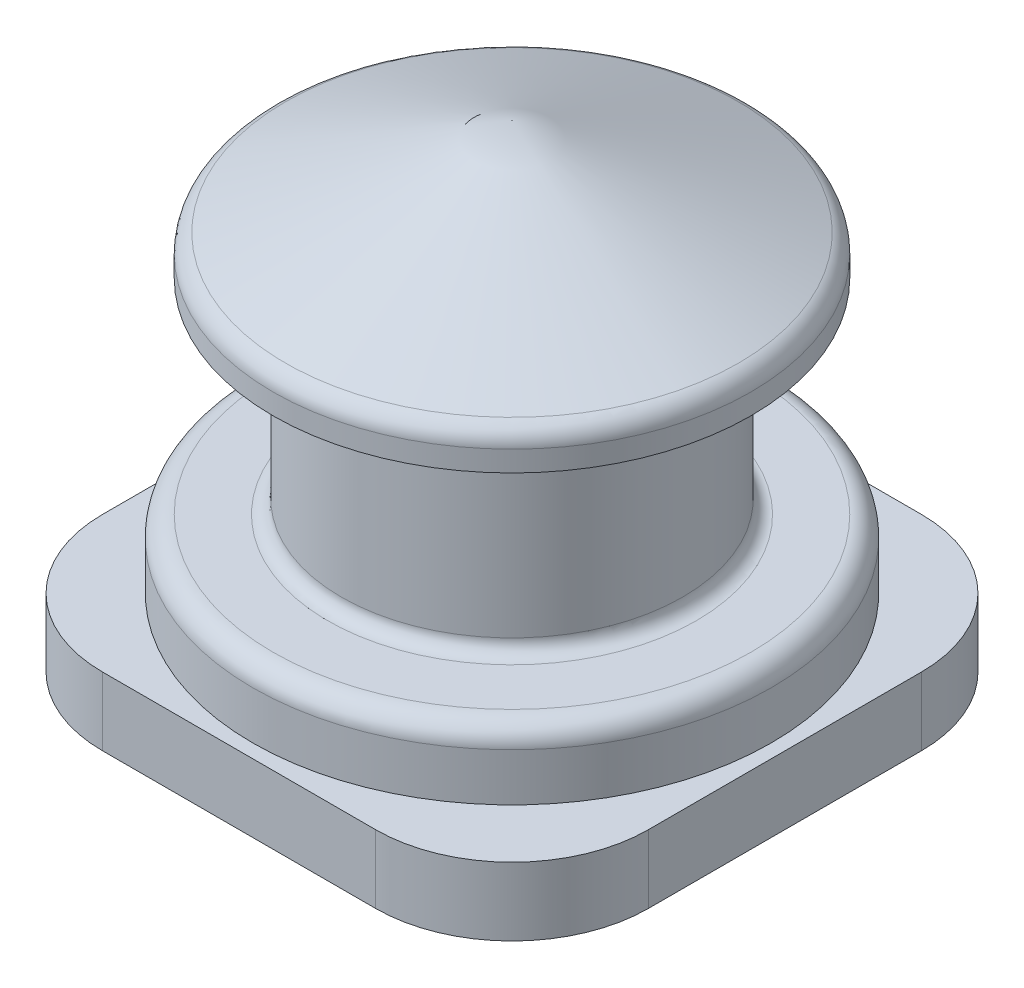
ISO-10303-21;
HEADER;
FILE_DESCRIPTION(('STEP AP214'),'2;1');
FILE_NAME('part.step','',(''),(''),'','','');
FILE_SCHEMA(('AUTOMOTIVE_DESIGN { 1 0 10303 214 1 1 1 1 }'));
ENDSEC;
DATA;
#1=APPLICATION_CONTEXT('core data for automotive mechanical design processes');
#2=APPLICATION_PROTOCOL_DEFINITION('international standard','automotive_design',2000,#1);
#3=PRODUCT_CONTEXT('',#1,'mechanical');
#4=PRODUCT('Part','Part','',(#3));
#5=PRODUCT_RELATED_PRODUCT_CATEGORY('part','',(#4));
#6=PRODUCT_DEFINITION_FORMATION('','',#4);
#7=PRODUCT_DEFINITION_CONTEXT('part definition',#1,'design');
#8=PRODUCT_DEFINITION('design','',#6,#7);
#9=PRODUCT_DEFINITION_SHAPE('','',#8);
#10=(LENGTH_UNIT() NAMED_UNIT(*) SI_UNIT(.MILLI.,.METRE.));
#11=(NAMED_UNIT(*) PLANE_ANGLE_UNIT() SI_UNIT($,.RADIAN.));
#12=(NAMED_UNIT(*) SI_UNIT($,.STERADIAN.) SOLID_ANGLE_UNIT());
#13=UNCERTAINTY_MEASURE_WITH_UNIT(LENGTH_MEASURE(1.E-05),#10,'distance_accuracy_value','');
#14=(GEOMETRIC_REPRESENTATION_CONTEXT(3) GLOBAL_UNCERTAINTY_ASSIGNED_CONTEXT((#13)) GLOBAL_UNIT_ASSIGNED_CONTEXT((#10,
#11,#12)) REPRESENTATION_CONTEXT('',''));
#15=CARTESIAN_POINT('',(0.,0.,0.));
#16=DIRECTION('',(0.,0.,1.));
#17=DIRECTION('',(1.,0.,0.));
#18=AXIS2_PLACEMENT_3D('',#15,#16,#17);
#19=CARTESIAN_POINT('',(0.,-10.,0.));
#20=DIRECTION('',(0.,1.,0.));
#21=DIRECTION('',(-1.,0.,0.));
#22=AXIS2_PLACEMENT_3D('',#19,#20,#21);
#23=PLANE('',#22);
#24=CARTESIAN_POINT('',(24.7487373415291,-10.,24.7487373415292));
#25=DIRECTION('',(0.,-1.,0.));
#26=DIRECTION('',(0.,0.,-1.));
#27=AXIS2_PLACEMENT_3D('',#24,#25,#26);
#28=CIRCLE('',#27,2.5);
#29=CARTESIAN_POINT('',(24.7487373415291,-10.,22.2487373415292));
#30=VERTEX_POINT('',#29);
#31=EDGE_CURVE('E127',#30,#30,#28,.T.);
#32=ORIENTED_EDGE('',*,*,#31,.F.);
#33=EDGE_LOOP('',(#32));
#34=FACE_BOUND('',#33,.T.);
#35=CARTESIAN_POINT('',(-24.7487373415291,-10.,-24.7487373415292));
#36=DIRECTION('',(0.,-1.,0.));
#37=DIRECTION('',(0.,0.,-1.));
#38=AXIS2_PLACEMENT_3D('',#35,#36,#37);
#39=CIRCLE('',#38,2.5);
#40=CARTESIAN_POINT('',(-24.7487373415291,-10.,-27.2487373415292));
#41=VERTEX_POINT('',#40);
#42=EDGE_CURVE('E144',#41,#41,#39,.T.);
#43=ORIENTED_EDGE('',*,*,#42,.F.);
#44=EDGE_LOOP('',(#43));
#45=FACE_BOUND('',#44,.T.);
#46=DIRECTION('',(1.,0.,0.));
#47=VECTOR('',#46,1.);
#48=CARTESIAN_POINT('',(-40.,-10.,-40.));
#49=LINE('',#48,#47);
#50=CARTESIAN_POINT('',(-20.,-10.,-40.));
#51=VERTEX_POINT('',#50);
#52=CARTESIAN_POINT('',(20.,-10.,-40.));
#53=VERTEX_POINT('',#52);
#54=EDGE_CURVE('E159',#51,#53,#49,.T.);
#55=ORIENTED_EDGE('',*,*,#54,.T.);
#56=CARTESIAN_POINT('',(20.,-10.,-20.));
#57=DIRECTION('',(0.,1.,0.));
#58=DIRECTION('',(-1.,0.,0.));
#59=AXIS2_PLACEMENT_3D('',#56,#57,#58);
#60=CIRCLE('',#59,20.);
#61=CARTESIAN_POINT('',(40.,-10.,-20.));
#62=VERTEX_POINT('',#61);
#63=EDGE_CURVE('E200',#53,#62,#60,.F.);
#64=ORIENTED_EDGE('',*,*,#63,.T.);
#65=DIRECTION('',(0.,0.,1.));
#66=VECTOR('',#65,1.);
#67=CARTESIAN_POINT('',(40.,-10.,-40.));
#68=LINE('',#67,#66);
#69=CARTESIAN_POINT('',(40.,-10.,20.));
#70=VERTEX_POINT('',#69);
#71=EDGE_CURVE('E151',#62,#70,#68,.T.);
#72=ORIENTED_EDGE('',*,*,#71,.T.);
#73=CARTESIAN_POINT('',(20.,-10.,20.));
#74=DIRECTION('',(0.,1.,0.));
#75=DIRECTION('',(-1.,0.,0.));
#76=AXIS2_PLACEMENT_3D('',#73,#74,#75);
#77=CIRCLE('',#76,20.);
#78=CARTESIAN_POINT('',(20.,-10.,40.));
#79=VERTEX_POINT('',#78);
#80=EDGE_CURVE('E195',#70,#79,#77,.F.);
#81=ORIENTED_EDGE('',*,*,#80,.T.);
#82=DIRECTION('',(-1.,0.,0.));
#83=VECTOR('',#82,1.);
#84=CARTESIAN_POINT('',(-40.,-10.,40.));
#85=LINE('',#84,#83);
#86=CARTESIAN_POINT('',(-20.,-10.,40.));
#87=VERTEX_POINT('',#86);
#88=EDGE_CURVE('E154',#79,#87,#85,.T.);
#89=ORIENTED_EDGE('',*,*,#88,.T.);
#90=CARTESIAN_POINT('',(-20.,-10.,20.));
#91=DIRECTION('',(0.,1.,0.));
#92=DIRECTION('',(-1.,0.,0.));
#93=AXIS2_PLACEMENT_3D('',#90,#91,#92);
#94=CIRCLE('',#93,20.);
#95=CARTESIAN_POINT('',(-40.,-10.,20.));
#96=VERTEX_POINT('',#95);
#97=EDGE_CURVE('E59',#87,#96,#94,.F.);
#98=ORIENTED_EDGE('',*,*,#97,.T.);
#99=DIRECTION('',(0.,0.,-1.));
#100=VECTOR('',#99,1.);
#101=CARTESIAN_POINT('',(-40.,-10.,-40.));
#102=LINE('',#101,#100);
#103=CARTESIAN_POINT('',(-40.,-10.,-20.));
#104=VERTEX_POINT('',#103);
#105=EDGE_CURVE('E157',#96,#104,#102,.T.);
#106=ORIENTED_EDGE('',*,*,#105,.T.);
#107=CARTESIAN_POINT('',(-20.,-10.,-20.));
#108=DIRECTION('',(0.,1.,0.));
#109=DIRECTION('',(-1.,0.,0.));
#110=AXIS2_PLACEMENT_3D('',#107,#108,#109);
#111=CIRCLE('',#110,20.);
#112=EDGE_CURVE('E198',#104,#51,#111,.F.);
#113=ORIENTED_EDGE('',*,*,#112,.T.);
#114=EDGE_LOOP('',(#55,#64,#72,#81,#89,#98,#106,#113));
#115=FACE_BOUND('',#114,.T.);
#116=CARTESIAN_POINT('',(-24.7487373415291,-10.,24.7487373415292));
#117=DIRECTION('',(0.,-1.,0.));
#118=DIRECTION('',(0.,0.,-1.));
#119=AXIS2_PLACEMENT_3D('',#116,#117,#118);
#120=CIRCLE('',#119,2.5);
#121=CARTESIAN_POINT('',(-24.7487373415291,-10.,22.2487373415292));
#122=VERTEX_POINT('',#121);
#123=EDGE_CURVE('E138',#122,#122,#120,.T.);
#124=ORIENTED_EDGE('',*,*,#123,.F.);
#125=EDGE_LOOP('',(#124));
#126=FACE_BOUND('',#125,.T.);
#127=CARTESIAN_POINT('',(24.748737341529,-10.,-24.7487373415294));
#128=DIRECTION('',(0.,-1.,0.));
#129=DIRECTION('',(0.,0.,-1.));
#130=AXIS2_PLACEMENT_3D('',#127,#128,#129);
#131=CIRCLE('',#130,2.5);
#132=CARTESIAN_POINT('',(24.748737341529,-10.,-27.2487373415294));
#133=VERTEX_POINT('',#132);
#134=EDGE_CURVE('E128',#133,#133,#131,.T.);
#135=ORIENTED_EDGE('',*,*,#134,.F.);
#136=EDGE_LOOP('',(#135));
#137=FACE_BOUND('',#136,.T.);
#138=ADVANCED_FACE('F37',(#34,#45,#115,#126,#137),#23,.F.);
#139=CARTESIAN_POINT('',(0.,60.,0.));
#140=DIRECTION('',(0.,1.,0.));
#141=DIRECTION('',(-1.,0.,0.));
#142=AXIS2_PLACEMENT_3D('',#139,#140,#141);
#143=CYLINDRICAL_SURFACE('',#142,38.);
#144=CARTESIAN_POINT('',(0.,7.,0.));
#145=DIRECTION('',(0.,-1.,0.));
#146=DIRECTION('',(1.,0.,0.));
#147=AXIS2_PLACEMENT_3D('',#144,#145,#146);
#148=CIRCLE('',#147,38.);
#149=CARTESIAN_POINT('',(38.,7.,0.));
#150=VERTEX_POINT('',#149);
#151=EDGE_CURVE('E11',#150,#150,#148,.T.);
#152=ORIENTED_EDGE('',*,*,#151,.T.);
#153=EDGE_LOOP('',(#152));
#154=FACE_BOUND('',#153,.T.);
#155=CARTESIAN_POINT('',(0.,0.,0.));
#156=DIRECTION('',(0.,1.,0.));
#157=DIRECTION('',(-1.,0.,0.));
#158=AXIS2_PLACEMENT_3D('',#155,#156,#157);
#159=CIRCLE('',#158,38.);
#160=CARTESIAN_POINT('',(-38.,0.,0.));
#161=VERTEX_POINT('',#160);
#162=EDGE_CURVE('E162',#161,#161,#159,.T.);
#163=ORIENTED_EDGE('',*,*,#162,.T.);
#164=EDGE_LOOP('',(#163));
#165=FACE_BOUND('',#164,.T.);
#166=ADVANCED_FACE('F249',(#154,#165),#143,.T.);
#167=CARTESIAN_POINT('',(38.,10.,0.));
#168=DIRECTION('',(0.,-1.,0.));
#169=DIRECTION('',(1.,0.,0.));
#170=AXIS2_PLACEMENT_3D('',#167,#168,#169);
#171=PLANE('',#170);
#172=CARTESIAN_POINT('',(0.,10.,0.));
#173=DIRECTION('',(0.,-1.,0.));
#174=DIRECTION('',(1.,0.,0.));
#175=AXIS2_PLACEMENT_3D('',#172,#173,#174);
#176=CIRCLE('',#175,35.);
#177=CARTESIAN_POINT('',(35.,10.,0.));
#178=VERTEX_POINT('',#177);
#179=EDGE_CURVE('E45',#178,#178,#176,.F.);
#180=ORIENTED_EDGE('',*,*,#179,.T.);
#181=EDGE_LOOP('',(#180));
#182=FACE_BOUND('',#181,.T.);
#183=CARTESIAN_POINT('',(0.,10.,0.));
#184=DIRECTION('',(0.,-1.,0.));
#185=DIRECTION('',(1.,0.,0.));
#186=AXIS2_PLACEMENT_3D('',#183,#184,#185);
#187=CIRCLE('',#186,27.);
#188=CARTESIAN_POINT('',(27.,10.,0.));
#189=VERTEX_POINT('',#188);
#190=EDGE_CURVE('E220',#189,#189,#187,.T.);
#191=ORIENTED_EDGE('',*,*,#190,.T.);
#192=EDGE_LOOP('',(#191));
#193=FACE_BOUND('',#192,.T.);
#194=ADVANCED_FACE('F231',(#182,#193),#171,.F.);
#195=CARTESIAN_POINT('',(0.,60.,0.));
#196=DIRECTION('',(0.,1.,0.));
#197=DIRECTION('',(-1.,0.,0.));
#198=AXIS2_PLACEMENT_3D('',#195,#196,#197);
#199=CYLINDRICAL_SURFACE('',#198,25.);
#200=CARTESIAN_POINT('',(0.,38.,0.));
#201=DIRECTION('',(0.,1.,0.));
#202=DIRECTION('',(-1.,0.,0.));
#203=AXIS2_PLACEMENT_3D('',#200,#201,#202);
#204=CIRCLE('',#203,25.);
#205=CARTESIAN_POINT('',(-25.,38.,0.));
#206=VERTEX_POINT('',#205);
#207=EDGE_CURVE('E217',#206,#206,#204,.F.);
#208=ORIENTED_EDGE('',*,*,#207,.T.);
#209=EDGE_LOOP('',(#208));
#210=FACE_BOUND('',#209,.T.);
#211=CARTESIAN_POINT('',(0.,12.,0.));
#212=DIRECTION('',(0.,-1.,0.));
#213=DIRECTION('',(1.,0.,0.));
#214=AXIS2_PLACEMENT_3D('',#211,#212,#213);
#215=CIRCLE('',#214,25.);
#216=CARTESIAN_POINT('',(25.,12.,0.));
#217=VERTEX_POINT('',#216);
#218=EDGE_CURVE('E214',#217,#217,#215,.F.);
#219=ORIENTED_EDGE('',*,*,#218,.T.);
#220=EDGE_LOOP('',(#219));
#221=FACE_BOUND('',#220,.T.);
#222=ADVANCED_FACE('F292',(#210,#221),#199,.T.);
#223=CARTESIAN_POINT('',(25.,40.,0.));
#224=DIRECTION('',(0.,1.,0.));
#225=DIRECTION('',(-1.,0.,0.));
#226=AXIS2_PLACEMENT_3D('',#223,#224,#225);
#227=PLANE('',#226);
#228=CARTESIAN_POINT('',(0.,40.,0.));
#229=DIRECTION('',(0.,1.,0.));
#230=DIRECTION('',(-1.,0.,0.));
#231=AXIS2_PLACEMENT_3D('',#228,#229,#230);
#232=CIRCLE('',#231,27.);
#233=CARTESIAN_POINT('',(-27.,40.,0.));
#234=VERTEX_POINT('',#233);
#235=EDGE_CURVE('E211',#234,#234,#232,.T.);
#236=ORIENTED_EDGE('',*,*,#235,.T.);
#237=EDGE_LOOP('',(#236));
#238=FACE_BOUND('',#237,.T.);
#239=CARTESIAN_POINT('',(0.,40.,0.));
#240=DIRECTION('',(0.,1.,0.));
#241=DIRECTION('',(-1.,0.,0.));
#242=AXIS2_PLACEMENT_3D('',#239,#240,#241);
#243=CIRCLE('',#242,35.);
#244=CARTESIAN_POINT('',(-35.,40.,0.));
#245=VERTEX_POINT('',#244);
#246=EDGE_CURVE('E174',#245,#245,#243,.T.);
#247=ORIENTED_EDGE('',*,*,#246,.F.);
#248=EDGE_LOOP('',(#247));
#249=FACE_BOUND('',#248,.T.);
#250=ADVANCED_FACE('F288',(#238,#249),#227,.F.);
#251=CARTESIAN_POINT('',(0.,60.,0.));
#252=DIRECTION('',(0.,1.,0.));
#253=DIRECTION('',(-1.,0.,0.));
#254=AXIS2_PLACEMENT_3D('',#251,#252,#253);
#255=CYLINDRICAL_SURFACE('',#254,35.);
#256=CARTESIAN_POINT('',(0.,43.0218115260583,0.));
#257=DIRECTION('',(0.,-1.,0.));
#258=DIRECTION('',(1.,0.,0.));
#259=AXIS2_PLACEMENT_3D('',#256,#257,#258);
#260=CIRCLE('',#259,35.);
#261=CARTESIAN_POINT('',(35.,43.0218115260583,0.));
#262=VERTEX_POINT('',#261);
#263=EDGE_CURVE('E226',#262,#262,#260,.T.);
#264=ORIENTED_EDGE('',*,*,#263,.T.);
#265=EDGE_LOOP('',(#264));
#266=FACE_BOUND('',#265,.T.);
#267=ORIENTED_EDGE('',*,*,#246,.T.);
#268=EDGE_LOOP('',(#267));
#269=FACE_BOUND('',#268,.T.);
#270=ADVANCED_FACE('F284',(#266,#269),#255,.T.);
#271=CARTESIAN_POINT('',(0.,45.,0.));
#272=DIRECTION('',(0.,-1.,0.));
#273=DIRECTION('',(1.,0.,0.));
#274=AXIS2_PLACEMENT_3D('',#271,#272,#273);
#275=CONICAL_SURFACE('',#274,35.,1.16590454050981);
#276=CARTESIAN_POINT('',(0.,45.7792466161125,0.));
#277=DIRECTION('',(0.,1.,0.));
#278=DIRECTION('',(-1.,0.,0.));
#279=AXIS2_PLACEMENT_3D('',#276,#277,#278);
#280=CIRCLE('',#279,33.1817578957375);
#281=CARTESIAN_POINT('',(-33.1817578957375,45.7792466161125,0.));
#282=VERTEX_POINT('',#281);
#283=EDGE_CURVE('E223',#282,#282,#280,.T.);
#284=ORIENTED_EDGE('',*,*,#283,.T.);
#285=EDGE_LOOP('',(#284));
#286=FACE_BOUND('',#285,.T.);
#287=CARTESIAN_POINT('',(0.,60.,0.));
#288=VERTEX_POINT('',#287);
#289=VERTEX_LOOP('',#288);
#290=FACE_BOUND('',#289,.T.);
#291=ADVANCED_FACE('F280',(#286,#290),#275,.T.);
#292=CARTESIAN_POINT('',(40.,-10.,-40.));
#293=DIRECTION('',(-1.,0.,0.));
#294=DIRECTION('',(0.,-1.,0.));
#295=AXIS2_PLACEMENT_3D('',#292,#293,#294);
#296=PLANE('',#295);
#297=ORIENTED_EDGE('',*,*,#71,.F.);
#298=DIRECTION('',(0.,1.,0.));
#299=VECTOR('',#298,1.);
#300=CARTESIAN_POINT('',(40.,-10.,-20.));
#301=LINE('',#300,#299);
#302=CARTESIAN_POINT('',(40.,0.,-20.));
#303=VERTEX_POINT('',#302);
#304=EDGE_CURVE('E179',#62,#303,#301,.T.);
#305=ORIENTED_EDGE('',*,*,#304,.T.);
#306=DIRECTION('',(0.,0.,1.));
#307=VECTOR('',#306,1.);
#308=CARTESIAN_POINT('',(40.,0.,-40.));
#309=LINE('',#308,#307);
#310=CARTESIAN_POINT('',(40.,0.,20.));
#311=VERTEX_POINT('',#310);
#312=EDGE_CURVE('E150',#303,#311,#309,.T.);
#313=ORIENTED_EDGE('',*,*,#312,.T.);
#314=DIRECTION('',(0.,1.,0.));
#315=VECTOR('',#314,1.);
#316=CARTESIAN_POINT('',(40.,-10.,20.));
#317=LINE('',#316,#315);
#318=EDGE_CURVE('E177',#311,#70,#317,.F.);
#319=ORIENTED_EDGE('',*,*,#318,.T.);
#320=EDGE_LOOP('',(#297,#305,#313,#319));
#321=FACE_BOUND('',#320,.T.);
#322=ADVANCED_FACE('F276',(#321),#296,.F.);
#323=CARTESIAN_POINT('',(-40.,-10.,40.));
#324=DIRECTION('',(0.,0.,-1.));
#325=DIRECTION('',(-1.,0.,0.));
#326=AXIS2_PLACEMENT_3D('',#323,#324,#325);
#327=PLANE('',#326);
#328=DIRECTION('',(-1.,0.,0.));
#329=VECTOR('',#328,1.);
#330=CARTESIAN_POINT('',(-40.,0.,40.));
#331=LINE('',#330,#329);
#332=CARTESIAN_POINT('',(20.,0.,40.));
#333=VERTEX_POINT('',#332);
#334=CARTESIAN_POINT('',(-20.,0.,40.));
#335=VERTEX_POINT('',#334);
#336=EDGE_CURVE('E165',#333,#335,#331,.T.);
#337=ORIENTED_EDGE('',*,*,#336,.T.);
#338=DIRECTION('',(0.,1.,0.));
#339=VECTOR('',#338,1.);
#340=CARTESIAN_POINT('',(-20.,-10.,40.));
#341=LINE('',#340,#339);
#342=EDGE_CURVE('E209',#335,#87,#341,.F.);
#343=ORIENTED_EDGE('',*,*,#342,.T.);
#344=ORIENTED_EDGE('',*,*,#88,.F.);
#345=DIRECTION('',(0.,1.,0.));
#346=VECTOR('',#345,1.);
#347=CARTESIAN_POINT('',(20.,-10.,40.));
#348=LINE('',#347,#346);
#349=EDGE_CURVE('E206',#79,#333,#348,.T.);
#350=ORIENTED_EDGE('',*,*,#349,.T.);
#351=EDGE_LOOP('',(#337,#343,#344,#350));
#352=FACE_BOUND('',#351,.T.);
#353=ADVANCED_FACE('F273',(#352),#327,.F.);
#354=CARTESIAN_POINT('',(-40.,-10.,-40.));
#355=DIRECTION('',(1.,0.,0.));
#356=DIRECTION('',(0.,1.,0.));
#357=AXIS2_PLACEMENT_3D('',#354,#355,#356);
#358=PLANE('',#357);
#359=DIRECTION('',(0.,0.,-1.));
#360=VECTOR('',#359,1.);
#361=CARTESIAN_POINT('',(-40.,0.,-40.));
#362=LINE('',#361,#360);
#363=CARTESIAN_POINT('',(-40.,0.,20.));
#364=VERTEX_POINT('',#363);
#365=CARTESIAN_POINT('',(-40.,0.,-20.));
#366=VERTEX_POINT('',#365);
#367=EDGE_CURVE('E168',#364,#366,#362,.T.);
#368=ORIENTED_EDGE('',*,*,#367,.T.);
#369=DIRECTION('',(0.,1.,0.));
#370=VECTOR('',#369,1.);
#371=CARTESIAN_POINT('',(-40.,-10.,-20.));
#372=LINE('',#371,#370);
#373=EDGE_CURVE('E52',#366,#104,#372,.F.);
#374=ORIENTED_EDGE('',*,*,#373,.T.);
#375=ORIENTED_EDGE('',*,*,#105,.F.);
#376=DIRECTION('',(0.,1.,0.));
#377=VECTOR('',#376,1.);
#378=CARTESIAN_POINT('',(-40.,-10.,20.));
#379=LINE('',#378,#377);
#380=EDGE_CURVE('E202',#96,#364,#379,.T.);
#381=ORIENTED_EDGE('',*,*,#380,.T.);
#382=EDGE_LOOP('',(#368,#374,#375,#381));
#383=FACE_BOUND('',#382,.T.);
#384=ADVANCED_FACE('F269',(#383),#358,.F.);
#385=CARTESIAN_POINT('',(-40.,-10.,-40.));
#386=DIRECTION('',(0.,0.,1.));
#387=DIRECTION('',(1.,0.,0.));
#388=AXIS2_PLACEMENT_3D('',#385,#386,#387);
#389=PLANE('',#388);
#390=DIRECTION('',(1.,0.,0.));
#391=VECTOR('',#390,1.);
#392=CARTESIAN_POINT('',(-40.,0.,-40.));
#393=LINE('',#392,#391);
#394=CARTESIAN_POINT('',(-20.,0.,-40.));
#395=VERTEX_POINT('',#394);
#396=CARTESIAN_POINT('',(20.,0.,-40.));
#397=VERTEX_POINT('',#396);
#398=EDGE_CURVE('E155',#395,#397,#393,.T.);
#399=ORIENTED_EDGE('',*,*,#398,.T.);
#400=DIRECTION('',(0.,1.,0.));
#401=VECTOR('',#400,1.);
#402=CARTESIAN_POINT('',(20.,-10.,-40.));
#403=LINE('',#402,#401);
#404=EDGE_CURVE('E193',#397,#53,#403,.F.);
#405=ORIENTED_EDGE('',*,*,#404,.T.);
#406=ORIENTED_EDGE('',*,*,#54,.F.);
#407=DIRECTION('',(0.,1.,0.));
#408=VECTOR('',#407,1.);
#409=CARTESIAN_POINT('',(-20.,-10.,-40.));
#410=LINE('',#409,#408);
#411=EDGE_CURVE('E190',#51,#395,#410,.T.);
#412=ORIENTED_EDGE('',*,*,#411,.T.);
#413=EDGE_LOOP('',(#399,#405,#406,#412));
#414=FACE_BOUND('',#413,.T.);
#415=ADVANCED_FACE('F265',(#414),#389,.F.);
#416=CARTESIAN_POINT('',(0.,0.,0.));
#417=DIRECTION('',(0.,1.,0.));
#418=DIRECTION('',(-1.,0.,0.));
#419=AXIS2_PLACEMENT_3D('',#416,#417,#418);
#420=PLANE('',#419);
#421=ORIENTED_EDGE('',*,*,#162,.F.);
#422=EDGE_LOOP('',(#421));
#423=FACE_BOUND('',#422,.T.);
#424=ORIENTED_EDGE('',*,*,#312,.F.);
#425=CARTESIAN_POINT('',(20.,0.,-20.));
#426=DIRECTION('',(0.,1.,0.));
#427=DIRECTION('',(-1.,0.,0.));
#428=AXIS2_PLACEMENT_3D('',#425,#426,#427);
#429=CIRCLE('',#428,20.);
#430=EDGE_CURVE('E188',#303,#397,#429,.T.);
#431=ORIENTED_EDGE('',*,*,#430,.T.);
#432=ORIENTED_EDGE('',*,*,#398,.F.);
#433=CARTESIAN_POINT('',(-20.,0.,-20.));
#434=DIRECTION('',(0.,1.,0.));
#435=DIRECTION('',(-1.,0.,0.));
#436=AXIS2_PLACEMENT_3D('',#433,#434,#435);
#437=CIRCLE('',#436,20.);
#438=EDGE_CURVE('E186',#395,#366,#437,.T.);
#439=ORIENTED_EDGE('',*,*,#438,.T.);
#440=ORIENTED_EDGE('',*,*,#367,.F.);
#441=CARTESIAN_POINT('',(-20.,0.,20.));
#442=DIRECTION('',(0.,1.,0.));
#443=DIRECTION('',(-1.,0.,0.));
#444=AXIS2_PLACEMENT_3D('',#441,#442,#443);
#445=CIRCLE('',#444,20.);
#446=EDGE_CURVE('E184',#364,#335,#445,.T.);
#447=ORIENTED_EDGE('',*,*,#446,.T.);
#448=ORIENTED_EDGE('',*,*,#336,.F.);
#449=CARTESIAN_POINT('',(20.,0.,20.));
#450=DIRECTION('',(0.,1.,0.));
#451=DIRECTION('',(-1.,0.,0.));
#452=AXIS2_PLACEMENT_3D('',#449,#450,#451);
#453=CIRCLE('',#452,20.);
#454=EDGE_CURVE('E182',#333,#311,#453,.T.);
#455=ORIENTED_EDGE('',*,*,#454,.T.);
#456=EDGE_LOOP('',(#424,#431,#432,#439,#440,#447,#448,#455));
#457=FACE_BOUND('',#456,.T.);
#458=ADVANCED_FACE('F261',(#423,#457),#420,.T.);
#459=CARTESIAN_POINT('',(20.,-10.,-20.));
#460=DIRECTION('',(0.,1.,0.));
#461=DIRECTION('',(-1.,0.,0.));
#462=AXIS2_PLACEMENT_3D('',#459,#460,#461);
#463=CYLINDRICAL_SURFACE('',#462,20.);
#464=ORIENTED_EDGE('',*,*,#63,.F.);
#465=ORIENTED_EDGE('',*,*,#404,.F.);
#466=ORIENTED_EDGE('',*,*,#430,.F.);
#467=ORIENTED_EDGE('',*,*,#304,.F.);
#468=EDGE_LOOP('',(#464,#465,#466,#467));
#469=FACE_BOUND('',#468,.T.);
#470=ADVANCED_FACE('F264',(#469),#463,.T.);
#471=CARTESIAN_POINT('',(-20.,-10.,-20.));
#472=DIRECTION('',(0.,1.,0.));
#473=DIRECTION('',(-1.,0.,0.));
#474=AXIS2_PLACEMENT_3D('',#471,#472,#473);
#475=CYLINDRICAL_SURFACE('',#474,20.);
#476=ORIENTED_EDGE('',*,*,#112,.F.);
#477=ORIENTED_EDGE('',*,*,#373,.F.);
#478=ORIENTED_EDGE('',*,*,#438,.F.);
#479=ORIENTED_EDGE('',*,*,#411,.F.);
#480=EDGE_LOOP('',(#476,#477,#478,#479));
#481=FACE_BOUND('',#480,.T.);
#482=ADVANCED_FACE('F301',(#481),#475,.T.);
#483=CARTESIAN_POINT('',(-20.,-10.,20.));
#484=DIRECTION('',(0.,1.,0.));
#485=DIRECTION('',(-1.,0.,0.));
#486=AXIS2_PLACEMENT_3D('',#483,#484,#485);
#487=CYLINDRICAL_SURFACE('',#486,20.);
#488=ORIENTED_EDGE('',*,*,#97,.F.);
#489=ORIENTED_EDGE('',*,*,#342,.F.);
#490=ORIENTED_EDGE('',*,*,#446,.F.);
#491=ORIENTED_EDGE('',*,*,#380,.F.);
#492=EDGE_LOOP('',(#488,#489,#490,#491));
#493=FACE_BOUND('',#492,.T.);
#494=ADVANCED_FACE('F305',(#493),#487,.T.);
#495=CARTESIAN_POINT('',(20.,-10.,20.));
#496=DIRECTION('',(0.,1.,0.));
#497=DIRECTION('',(-1.,0.,0.));
#498=AXIS2_PLACEMENT_3D('',#495,#496,#497);
#499=CYLINDRICAL_SURFACE('',#498,20.);
#500=ORIENTED_EDGE('',*,*,#80,.F.);
#501=ORIENTED_EDGE('',*,*,#318,.F.);
#502=ORIENTED_EDGE('',*,*,#454,.F.);
#503=ORIENTED_EDGE('',*,*,#349,.F.);
#504=EDGE_LOOP('',(#500,#501,#502,#503));
#505=FACE_BOUND('',#504,.T.);
#506=ADVANCED_FACE('F309',(#505),#499,.T.);
#507=CARTESIAN_POINT('',(0.,38.,0.));
#508=DIRECTION('',(0.,1.,0.));
#509=DIRECTION('',(-1.,0.,0.));
#510=AXIS2_PLACEMENT_3D('',#507,#508,#509);
#511=TOROIDAL_SURFACE('',#510,27.,2.);
#512=ORIENTED_EDGE('',*,*,#207,.F.);
#513=EDGE_LOOP('',(#512));
#514=FACE_BOUND('',#513,.T.);
#515=ORIENTED_EDGE('',*,*,#235,.F.);
#516=EDGE_LOOP('',(#515));
#517=FACE_BOUND('',#516,.T.);
#518=ADVANCED_FACE('F313',(#514,#517),#511,.F.);
#519=CARTESIAN_POINT('',(0.,12.,0.));
#520=DIRECTION('',(0.,-1.,0.));
#521=DIRECTION('',(1.,0.,0.));
#522=AXIS2_PLACEMENT_3D('',#519,#520,#521);
#523=TOROIDAL_SURFACE('',#522,27.,2.);
#524=ORIENTED_EDGE('',*,*,#190,.F.);
#525=EDGE_LOOP('',(#524));
#526=FACE_BOUND('',#525,.T.);
#527=ORIENTED_EDGE('',*,*,#218,.F.);
#528=EDGE_LOOP('',(#527));
#529=FACE_BOUND('',#528,.T.);
#530=ADVANCED_FACE('F245',(#526,#529),#523,.F.);
#531=CARTESIAN_POINT('',(0.,43.0218115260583,0.));
#532=DIRECTION('',(0.,-1.,0.));
#533=DIRECTION('',(1.,0.,0.));
#534=AXIS2_PLACEMENT_3D('',#531,#532,#533);
#535=TOROIDAL_SURFACE('',#534,32.,3.);
#536=ORIENTED_EDGE('',*,*,#263,.F.);
#537=EDGE_LOOP('',(#536));
#538=FACE_BOUND('',#537,.T.);
#539=ORIENTED_EDGE('',*,*,#283,.F.);
#540=EDGE_LOOP('',(#539));
#541=FACE_BOUND('',#540,.T.);
#542=ADVANCED_FACE('F236',(#538,#541),#535,.T.);
#543=CARTESIAN_POINT('',(0.,7.,0.));
#544=DIRECTION('',(0.,-1.,0.));
#545=DIRECTION('',(1.,0.,0.));
#546=AXIS2_PLACEMENT_3D('',#543,#544,#545);
#547=TOROIDAL_SURFACE('',#546,35.,3.);
#548=ORIENTED_EDGE('',*,*,#151,.F.);
#549=EDGE_LOOP('',(#548));
#550=FACE_BOUND('',#549,.T.);
#551=ORIENTED_EDGE('',*,*,#179,.F.);
#552=EDGE_LOOP('',(#551));
#553=FACE_BOUND('',#552,.T.);
#554=ADVANCED_FACE('F39',(#550,#553),#547,.T.);
#555=CARTESIAN_POINT('',(-24.7487373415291,7.,-24.7487373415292));
#556=DIRECTION('',(0.,-1.,0.));
#557=DIRECTION('',(0.,0.,-1.));
#558=AXIS2_PLACEMENT_3D('',#555,#556,#557);
#559=CONICAL_SURFACE('',#558,2.5,1.02974425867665);
#560=CARTESIAN_POINT('',(-24.7487373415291,8.5021515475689,-24.7487373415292));
#561=VERTEX_POINT('',#560);
#562=VERTEX_LOOP('',#561);
#563=FACE_BOUND('',#562,.T.);
#564=CARTESIAN_POINT('',(-24.7487373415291,7.,-24.7487373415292));
#565=DIRECTION('',(0.,-1.,0.));
#566=DIRECTION('',(0.,0.,-1.));
#567=AXIS2_PLACEMENT_3D('',#564,#565,#566);
#568=CIRCLE('',#567,2.5);
#569=CARTESIAN_POINT('',(-24.7487373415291,7.,-27.2487373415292));
#570=VERTEX_POINT('',#569);
#571=EDGE_CURVE('E147',#570,#570,#568,.T.);
#572=ORIENTED_EDGE('',*,*,#571,.T.);
#573=EDGE_LOOP('',(#572));
#574=FACE_BOUND('',#573,.T.);
#575=ADVANCED_FACE('F235',(#563,#574),#559,.F.);
#576=CARTESIAN_POINT('',(-24.7487373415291,-10.,-24.7487373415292));
#577=DIRECTION('',(0.,-1.,0.));
#578=DIRECTION('',(0.,0.,-1.));
#579=AXIS2_PLACEMENT_3D('',#576,#577,#578);
#580=CYLINDRICAL_SURFACE('',#579,2.5);
#581=ORIENTED_EDGE('',*,*,#571,.F.);
#582=EDGE_LOOP('',(#581));
#583=FACE_BOUND('',#582,.T.);
#584=ORIENTED_EDGE('',*,*,#42,.T.);
#585=EDGE_LOOP('',(#584));
#586=FACE_BOUND('',#585,.T.);
#587=ADVANCED_FACE('F242',(#583,#586),#580,.F.);
#588=CARTESIAN_POINT('',(-24.7487373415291,7.,24.7487373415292));
#589=DIRECTION('',(0.,-1.,0.));
#590=DIRECTION('',(0.,0.,-1.));
#591=AXIS2_PLACEMENT_3D('',#588,#589,#590);
#592=CONICAL_SURFACE('',#591,2.5,1.02974425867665);
#593=CARTESIAN_POINT('',(-24.7487373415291,8.5021515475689,24.7487373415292));
#594=VERTEX_POINT('',#593);
#595=VERTEX_LOOP('',#594);
#596=FACE_BOUND('',#595,.T.);
#597=CARTESIAN_POINT('',(-24.7487373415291,7.,24.7487373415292));
#598=DIRECTION('',(0.,-1.,0.));
#599=DIRECTION('',(0.,0.,-1.));
#600=AXIS2_PLACEMENT_3D('',#597,#598,#599);
#601=CIRCLE('',#600,2.5);
#602=CARTESIAN_POINT('',(-24.7487373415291,7.,22.2487373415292));
#603=VERTEX_POINT('',#602);
#604=EDGE_CURVE('E141',#603,#603,#601,.T.);
#605=ORIENTED_EDGE('',*,*,#604,.T.);
#606=EDGE_LOOP('',(#605));
#607=FACE_BOUND('',#606,.T.);
#608=ADVANCED_FACE('F356',(#596,#607),#592,.F.);
#609=CARTESIAN_POINT('',(-24.7487373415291,-10.,24.7487373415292));
#610=DIRECTION('',(0.,-1.,0.));
#611=DIRECTION('',(0.,0.,-1.));
#612=AXIS2_PLACEMENT_3D('',#609,#610,#611);
#613=CYLINDRICAL_SURFACE('',#612,2.5);
#614=ORIENTED_EDGE('',*,*,#604,.F.);
#615=EDGE_LOOP('',(#614));
#616=FACE_BOUND('',#615,.T.);
#617=ORIENTED_EDGE('',*,*,#123,.T.);
#618=EDGE_LOOP('',(#617));
#619=FACE_BOUND('',#618,.T.);
#620=ADVANCED_FACE('F372',(#616,#619),#613,.F.);
#621=CARTESIAN_POINT('',(24.7487373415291,7.,24.7487373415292));
#622=DIRECTION('',(0.,-1.,0.));
#623=DIRECTION('',(0.,0.,-1.));
#624=AXIS2_PLACEMENT_3D('',#621,#622,#623);
#625=CONICAL_SURFACE('',#624,2.5,1.02974425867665);
#626=CARTESIAN_POINT('',(24.7487373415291,8.5021515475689,24.7487373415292));
#627=VERTEX_POINT('',#626);
#628=VERTEX_LOOP('',#627);
#629=FACE_BOUND('',#628,.T.);
#630=CARTESIAN_POINT('',(24.7487373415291,7.,24.7487373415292));
#631=DIRECTION('',(0.,-1.,0.));
#632=DIRECTION('',(0.,0.,-1.));
#633=AXIS2_PLACEMENT_3D('',#630,#631,#632);
#634=CIRCLE('',#633,2.5);
#635=CARTESIAN_POINT('',(24.7487373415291,7.,22.2487373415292));
#636=VERTEX_POINT('',#635);
#637=EDGE_CURVE('E131',#636,#636,#634,.T.);
#638=ORIENTED_EDGE('',*,*,#637,.T.);
#639=EDGE_LOOP('',(#638));
#640=FACE_BOUND('',#639,.T.);
#641=ADVANCED_FACE('F383',(#629,#640),#625,.F.);
#642=CARTESIAN_POINT('',(24.7487373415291,-10.,24.7487373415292));
#643=DIRECTION('',(0.,-1.,0.));
#644=DIRECTION('',(0.,0.,-1.));
#645=AXIS2_PLACEMENT_3D('',#642,#643,#644);
#646=CYLINDRICAL_SURFACE('',#645,2.5);
#647=ORIENTED_EDGE('',*,*,#637,.F.);
#648=EDGE_LOOP('',(#647));
#649=FACE_BOUND('',#648,.T.);
#650=ORIENTED_EDGE('',*,*,#31,.T.);
#651=EDGE_LOOP('',(#650));
#652=FACE_BOUND('',#651,.T.);
#653=ADVANCED_FACE('F121',(#649,#652),#646,.F.);
#654=CARTESIAN_POINT('',(24.748737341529,7.,-24.7487373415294));
#655=DIRECTION('',(0.,-1.,0.));
#656=DIRECTION('',(0.,0.,-1.));
#657=AXIS2_PLACEMENT_3D('',#654,#655,#656);
#658=CONICAL_SURFACE('',#657,2.5,1.02974425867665);
#659=CARTESIAN_POINT('',(24.7487373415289,8.5021515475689,-24.7487373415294));
#660=VERTEX_POINT('',#659);
#661=VERTEX_LOOP('',#660);
#662=FACE_BOUND('',#661,.T.);
#663=CARTESIAN_POINT('',(24.748737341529,7.,-24.7487373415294));
#664=DIRECTION('',(0.,-1.,0.));
#665=DIRECTION('',(0.,0.,-1.));
#666=AXIS2_PLACEMENT_3D('',#663,#664,#665);
#667=CIRCLE('',#666,2.5);
#668=CARTESIAN_POINT('',(24.748737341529,7.,-27.2487373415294));
#669=VERTEX_POINT('',#668);
#670=EDGE_CURVE('E125',#669,#669,#667,.T.);
#671=ORIENTED_EDGE('',*,*,#670,.T.);
#672=EDGE_LOOP('',(#671));
#673=FACE_BOUND('',#672,.T.);
#674=ADVANCED_FACE('F117',(#662,#673),#658,.F.);
#675=CARTESIAN_POINT('',(24.748737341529,-10.,-24.7487373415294));
#676=DIRECTION('',(0.,-1.,0.));
#677=DIRECTION('',(0.,0.,-1.));
#678=AXIS2_PLACEMENT_3D('',#675,#676,#677);
#679=CYLINDRICAL_SURFACE('',#678,2.5);
#680=ORIENTED_EDGE('',*,*,#670,.F.);
#681=EDGE_LOOP('',(#680));
#682=FACE_BOUND('',#681,.T.);
#683=ORIENTED_EDGE('',*,*,#134,.T.);
#684=EDGE_LOOP('',(#683));
#685=FACE_BOUND('',#684,.T.);
#686=ADVANCED_FACE('F120',(#682,#685),#679,.F.);
#687=CLOSED_SHELL('',(#138,#166,#194,#222,#250,#270,#291,#322,#353,#384,#415,#458,#470,#482,
#494,#506,#518,#530,#542,#554,#575,#587,#608,#620,#641,#653,#674,#686));
#688=MANIFOLD_SOLID_BREP('B2',#687);
#689=ADVANCED_BREP_SHAPE_REPRESENTATION('',(#18,#688),#14);
#690=SHAPE_DEFINITION_REPRESENTATION(#9,#689);
ENDSEC;
END-ISO-10303-21;
